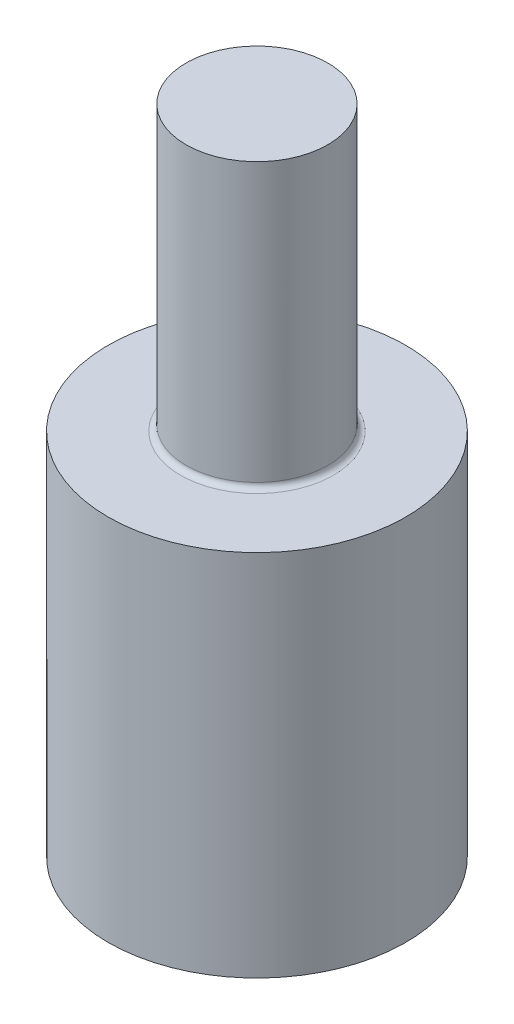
ISO-10303-21;
HEADER;
FILE_DESCRIPTION(('STEP AP214'),'2;1');
FILE_NAME('part.step','',(''),(''),'','','');
FILE_SCHEMA(('AUTOMOTIVE_DESIGN { 1 0 10303 214 1 1 1 1 }'));
ENDSEC;
DATA;
#1=APPLICATION_CONTEXT('core data for automotive mechanical design processes');
#2=APPLICATION_PROTOCOL_DEFINITION('international standard','automotive_design',2000,#1);
#3=PRODUCT_CONTEXT('',#1,'mechanical');
#4=PRODUCT('Part','Part','',(#3));
#5=PRODUCT_RELATED_PRODUCT_CATEGORY('part','',(#4));
#6=PRODUCT_DEFINITION_FORMATION('','',#4);
#7=PRODUCT_DEFINITION_CONTEXT('part definition',#1,'design');
#8=PRODUCT_DEFINITION('design','',#6,#7);
#9=PRODUCT_DEFINITION_SHAPE('','',#8);
#10=(LENGTH_UNIT() NAMED_UNIT(*) SI_UNIT(.MILLI.,.METRE.));
#11=(NAMED_UNIT(*) PLANE_ANGLE_UNIT() SI_UNIT($,.RADIAN.));
#12=(NAMED_UNIT(*) SI_UNIT($,.STERADIAN.) SOLID_ANGLE_UNIT());
#13=UNCERTAINTY_MEASURE_WITH_UNIT(LENGTH_MEASURE(1.E-05),#10,'distance_accuracy_value','');
#14=(GEOMETRIC_REPRESENTATION_CONTEXT(3) GLOBAL_UNCERTAINTY_ASSIGNED_CONTEXT((#13)) GLOBAL_UNIT_ASSIGNED_CONTEXT((#10,
#11,#12)) REPRESENTATION_CONTEXT('',''));
#15=CARTESIAN_POINT('',(0.,0.,0.));
#16=DIRECTION('',(0.,0.,1.));
#17=DIRECTION('',(1.,0.,0.));
#18=AXIS2_PLACEMENT_3D('',#15,#16,#17);
#19=CARTESIAN_POINT('',(0.,23.,0.));
#20=DIRECTION('',(0.,-1.,0.));
#21=DIRECTION('',(0.,0.,-1.));
#22=AXIS2_PLACEMENT_3D('',#19,#20,#21);
#23=PLANE('',#22);
#24=CARTESIAN_POINT('',(0.,23.,0.));
#25=DIRECTION('',(0.,1.,0.));
#26=DIRECTION('',(0.,0.,1.));
#27=AXIS2_PLACEMENT_3D('',#24,#25,#26);
#28=CIRCLE('',#27,2.5);
#29=CARTESIAN_POINT('',(0.,23.,2.5));
#30=VERTEX_POINT('',#29);
#31=EDGE_CURVE('E23',#30,#30,#28,.T.);
#32=ORIENTED_EDGE('',*,*,#31,.T.);
#33=EDGE_LOOP('',(#32));
#34=FACE_BOUND('',#33,.T.);
#35=ADVANCED_FACE('F12',(#34),#23,.F.);
#36=CARTESIAN_POINT('',(0.,23.,0.));
#37=DIRECTION('',(0.,1.,0.));
#38=DIRECTION('',(0.,0.,1.));
#39=AXIS2_PLACEMENT_3D('',#36,#37,#38);
#40=CYLINDRICAL_SURFACE('',#39,2.5);
#41=CARTESIAN_POINT('',(0.,13.2,0.));
#42=DIRECTION('',(0.,-1.,0.));
#43=DIRECTION('',(0.,0.,-1.));
#44=AXIS2_PLACEMENT_3D('',#41,#42,#43);
#45=CIRCLE('',#44,2.5);
#46=CARTESIAN_POINT('',(0.,13.2,-2.5));
#47=VERTEX_POINT('',#46);
#48=EDGE_CURVE('E19',#47,#47,#45,.F.);
#49=ORIENTED_EDGE('',*,*,#48,.T.);
#50=EDGE_LOOP('',(#49));
#51=FACE_BOUND('',#50,.T.);
#52=ORIENTED_EDGE('',*,*,#31,.F.);
#53=EDGE_LOOP('',(#52));
#54=FACE_BOUND('',#53,.T.);
#55=ADVANCED_FACE('F51',(#51,#54),#40,.T.);
#56=CARTESIAN_POINT('',(2.5,13.,0.));
#57=DIRECTION('',(0.,-1.,0.));
#58=DIRECTION('',(0.,0.,-1.));
#59=AXIS2_PLACEMENT_3D('',#56,#57,#58);
#60=PLANE('',#59);
#61=CARTESIAN_POINT('',(0.,13.,0.));
#62=DIRECTION('',(0.,-1.,0.));
#63=DIRECTION('',(0.,0.,-1.));
#64=AXIS2_PLACEMENT_3D('',#61,#62,#63);
#65=CIRCLE('',#64,2.7);
#66=CARTESIAN_POINT('',(0.,13.,-2.7));
#67=VERTEX_POINT('',#66);
#68=EDGE_CURVE('E8',#67,#67,#65,.T.);
#69=ORIENTED_EDGE('',*,*,#68,.T.);
#70=EDGE_LOOP('',(#69));
#71=FACE_BOUND('',#70,.T.);
#72=CARTESIAN_POINT('',(0.,13.,0.));
#73=DIRECTION('',(0.,1.,0.));
#74=DIRECTION('',(0.,0.,1.));
#75=AXIS2_PLACEMENT_3D('',#72,#73,#74);
#76=CIRCLE('',#75,5.25);
#77=CARTESIAN_POINT('',(0.,13.,5.25));
#78=VERTEX_POINT('',#77);
#79=EDGE_CURVE('E27',#78,#78,#76,.T.);
#80=ORIENTED_EDGE('',*,*,#79,.T.);
#81=EDGE_LOOP('',(#80));
#82=FACE_BOUND('',#81,.T.);
#83=ADVANCED_FACE('F47',(#71,#82),#60,.F.);
#84=CARTESIAN_POINT('',(0.,23.,0.));
#85=DIRECTION('',(0.,1.,0.));
#86=DIRECTION('',(0.,0.,1.));
#87=AXIS2_PLACEMENT_3D('',#84,#85,#86);
#88=CYLINDRICAL_SURFACE('',#87,5.25);
#89=ORIENTED_EDGE('',*,*,#79,.F.);
#90=EDGE_LOOP('',(#89));
#91=FACE_BOUND('',#90,.T.);
#92=CARTESIAN_POINT('',(0.,0.,0.));
#93=DIRECTION('',(0.,1.,0.));
#94=DIRECTION('',(0.,0.,1.));
#95=AXIS2_PLACEMENT_3D('',#92,#93,#94);
#96=CIRCLE('',#95,5.25);
#97=CARTESIAN_POINT('',(0.,0.,5.25));
#98=VERTEX_POINT('',#97);
#99=EDGE_CURVE('E32',#98,#98,#96,.T.);
#100=ORIENTED_EDGE('',*,*,#99,.T.);
#101=EDGE_LOOP('',(#100));
#102=FACE_BOUND('',#101,.T.);
#103=ADVANCED_FACE('F36',(#91,#102),#88,.T.);
#104=CARTESIAN_POINT('',(5.25,0.,0.));
#105=DIRECTION('',(0.,1.,0.));
#106=DIRECTION('',(0.,0.,1.));
#107=AXIS2_PLACEMENT_3D('',#104,#105,#106);
#108=PLANE('',#107);
#109=ORIENTED_EDGE('',*,*,#99,.F.);
#110=EDGE_LOOP('',(#109));
#111=FACE_BOUND('',#110,.T.);
#112=ADVANCED_FACE('F38',(#111),#108,.F.);
#113=CARTESIAN_POINT('',(0.,13.2,0.));
#114=DIRECTION('',(0.,-1.,0.));
#115=DIRECTION('',(0.,0.,-1.));
#116=AXIS2_PLACEMENT_3D('',#113,#114,#115);
#117=TOROIDAL_SURFACE('',#116,2.7,0.2);
#118=ORIENTED_EDGE('',*,*,#68,.F.);
#119=EDGE_LOOP('',(#118));
#120=FACE_BOUND('',#119,.T.);
#121=ORIENTED_EDGE('',*,*,#48,.F.);
#122=EDGE_LOOP('',(#121));
#123=FACE_BOUND('',#122,.T.);
#124=ADVANCED_FACE('F14',(#120,#123),#117,.F.);
#125=CLOSED_SHELL('',(#35,#55,#83,#103,#112,#124));
#126=MANIFOLD_SOLID_BREP('B1',#125);
#127=ADVANCED_BREP_SHAPE_REPRESENTATION('',(#18,#126),#14);
#128=SHAPE_DEFINITION_REPRESENTATION(#9,#127);
ENDSEC;
END-ISO-10303-21;
